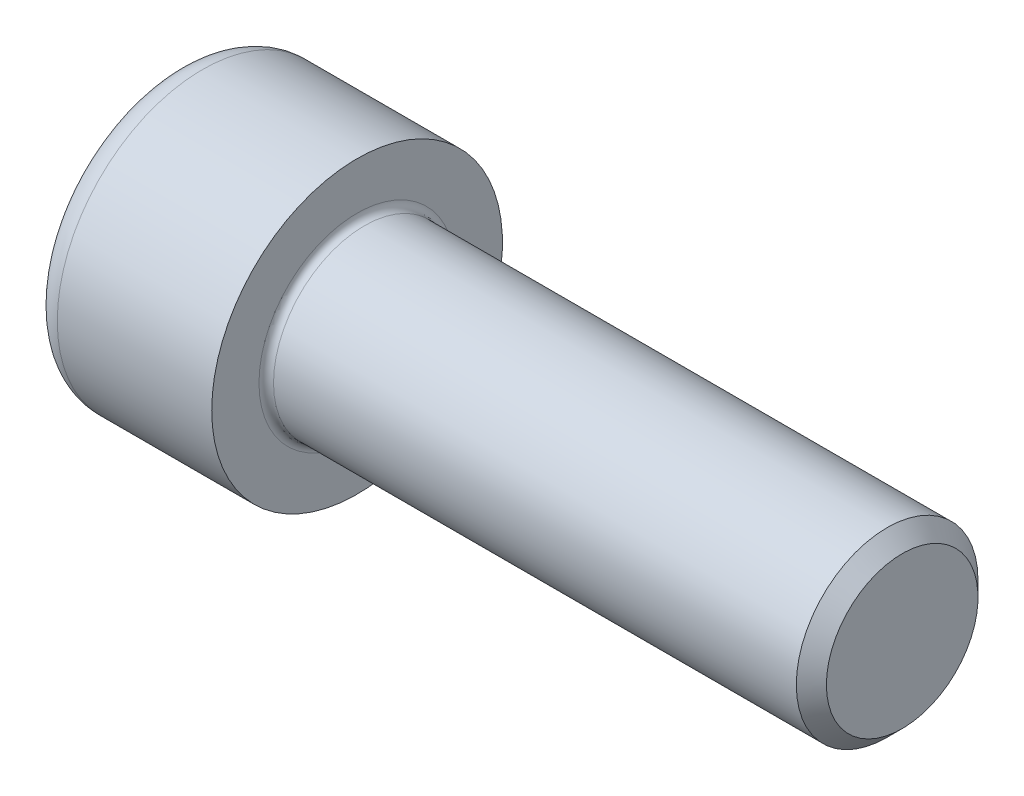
from build123d import *

# Parameters (mm, degrees)
FILLET1_R   = 0.4
FILLET2_R   = 1.5
HEX_2_DEPTH = 5


with BuildPart() as part:
    # BodySke → Base-Revolve (revolve)
    with BuildSketch(Plane.XY, mode=Mode.PRIVATE) as base_revolve_sk:
        Polygon((0, 0), (0, 8), (10, 8), (10, 5), (39.172, 5), (40, 4.172), (40, 0), align=None)
    revolve(base_revolve_sk.sketch.rotate(Axis((-31.75, 0, 0), (1, 0, 0)), 90), axis=Axis((-31.75, 0, 0), (1, 0, 0)))

    # Fillet1
    fillet1_edges = [part.edges().sort_by_distance(p)[0] for p in [
        (10, 0, -5),
    ]]
    fillet(fillet1_edges, radius=FILLET1_R)

    # Fillet2
    fillet2_edges = [part.edges().sort_by_distance(p)[0] for p in [
        (0, 0, -8),
    ]]
    fillet(fillet2_edges, radius=FILLET2_R)

    # Sketch2 → Hex-PreBroach (revolve, cut)
    with BuildSketch(Plane.XY, mode=Mode.PRIVATE) as hex_prebroach_sk:
        Polygon((0, 4.0575), (5, 4.0575), (7.342598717, 0), (0, 0), align=None)
    revolve(hex_prebroach_sk.sketch.rotate(Axis((0, 0, 0), (1, 0, 0)), 90), axis=Axis((0, 0, 0), (1, 0, 0)), mode=Mode.SUBTRACT)

    # Sketch3 → Hex 2 (cut)
    with BuildSketch(Plane(origin=(0, 0, 0), x_dir=(0, 0.500000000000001, 0.866025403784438), z_dir=(-1, 0, 0))):
        Polygon((2.342598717, 4.0575), (-2.342598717, 4.0575), (-4.685197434, 0), (-2.342598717, -4.0575), (2.342598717, -4.0575), (4.685197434, 0), align=None)
    extrude(amount=-HEX_2_DEPTH, mode=Mode.SUBTRACT)


solid = part.part
